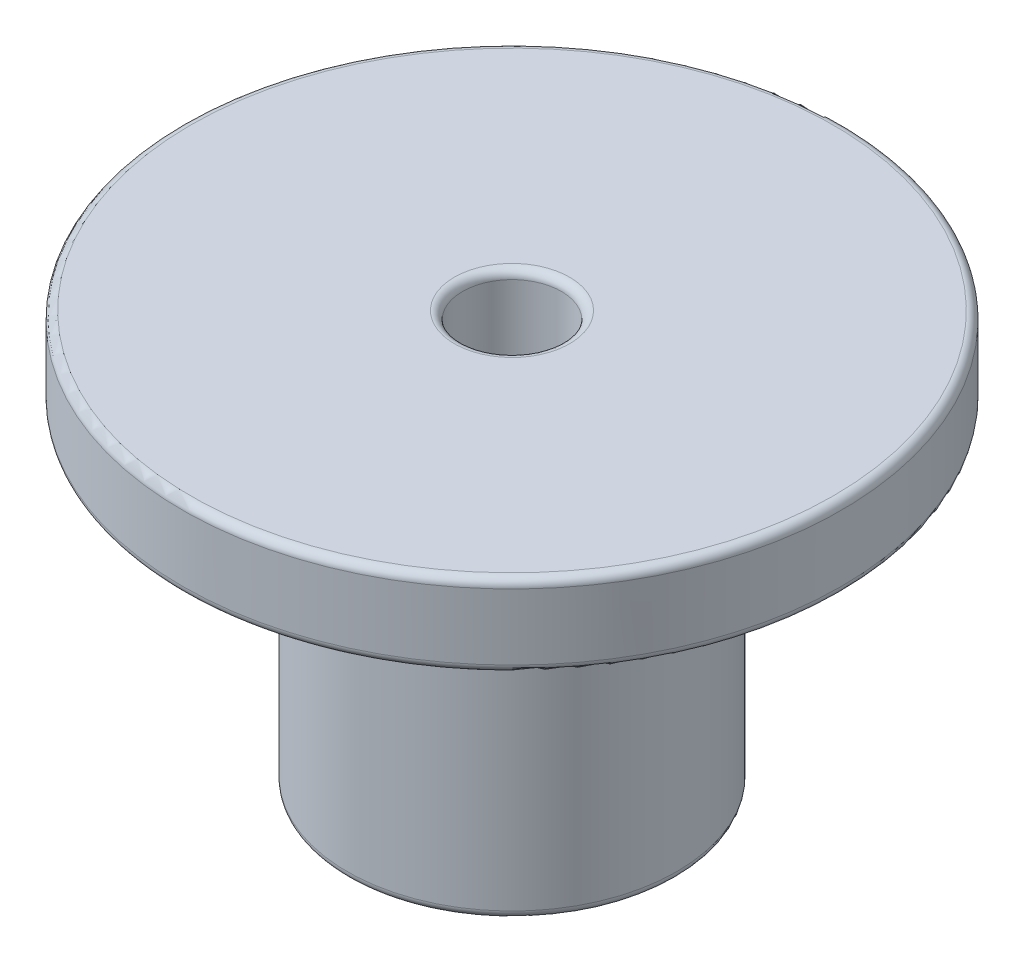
ISO-10303-21;
HEADER;
FILE_DESCRIPTION(('STEP AP214'),'2;1');
FILE_NAME('part.step','',(''),(''),'','','');
FILE_SCHEMA(('AUTOMOTIVE_DESIGN { 1 0 10303 214 1 1 1 1 }'));
ENDSEC;
DATA;
#1=APPLICATION_CONTEXT('core data for automotive mechanical design processes');
#2=APPLICATION_PROTOCOL_DEFINITION('international standard','automotive_design',2000,#1);
#3=PRODUCT_CONTEXT('',#1,'mechanical');
#4=PRODUCT('Part','Part','',(#3));
#5=PRODUCT_RELATED_PRODUCT_CATEGORY('part','',(#4));
#6=PRODUCT_DEFINITION_FORMATION('','',#4);
#7=PRODUCT_DEFINITION_CONTEXT('part definition',#1,'design');
#8=PRODUCT_DEFINITION('design','',#6,#7);
#9=PRODUCT_DEFINITION_SHAPE('','',#8);
#10=(LENGTH_UNIT() NAMED_UNIT(*) SI_UNIT(.MILLI.,.METRE.));
#11=(NAMED_UNIT(*) PLANE_ANGLE_UNIT() SI_UNIT($,.RADIAN.));
#12=(NAMED_UNIT(*) SI_UNIT($,.STERADIAN.) SOLID_ANGLE_UNIT());
#13=UNCERTAINTY_MEASURE_WITH_UNIT(LENGTH_MEASURE(1.E-05),#10,'distance_accuracy_value','');
#14=(GEOMETRIC_REPRESENTATION_CONTEXT(3) GLOBAL_UNCERTAINTY_ASSIGNED_CONTEXT((#13)) GLOBAL_UNIT_ASSIGNED_CONTEXT((#10,
#11,#12)) REPRESENTATION_CONTEXT('',''));
#15=CARTESIAN_POINT('',(0.,0.,0.));
#16=DIRECTION('',(0.,0.,1.));
#17=DIRECTION('',(1.,0.,0.));
#18=AXIS2_PLACEMENT_3D('',#15,#16,#17);
#19=CARTESIAN_POINT('',(-10.,0.,0.));
#20=DIRECTION('',(0.,1.,0.));
#21=DIRECTION('',(-1.,0.,0.));
#22=AXIS2_PLACEMENT_3D('',#19,#20,#21);
#23=PLANE('',#22);
#24=CARTESIAN_POINT('',(0.,0.,0.));
#25=DIRECTION('',(0.,1.,0.));
#26=DIRECTION('',(-1.,0.,0.));
#27=AXIS2_PLACEMENT_3D('',#24,#25,#26);
#28=CIRCLE('',#27,1.75);
#29=CARTESIAN_POINT('',(-1.75,0.,0.));
#30=VERTEX_POINT('',#29);
#31=EDGE_CURVE('E55',#30,#30,#28,.F.);
#32=ORIENTED_EDGE('',*,*,#31,.T.);
#33=EDGE_LOOP('',(#32));
#34=FACE_BOUND('',#33,.T.);
#35=CARTESIAN_POINT('',(0.,0.,0.));
#36=DIRECTION('',(0.,1.,0.));
#37=DIRECTION('',(-1.,0.,0.));
#38=AXIS2_PLACEMENT_3D('',#35,#36,#37);
#39=CIRCLE('',#38,9.75);
#40=CARTESIAN_POINT('',(-9.75,0.,0.));
#41=VERTEX_POINT('',#40);
#42=EDGE_CURVE('E58',#41,#41,#39,.T.);
#43=ORIENTED_EDGE('',*,*,#42,.T.);
#44=EDGE_LOOP('',(#43));
#45=FACE_BOUND('',#44,.T.);
#46=ADVANCED_FACE('F29',(#34,#45),#23,.T.);
#47=CARTESIAN_POINT('',(0.,0.,0.));
#48=DIRECTION('',(0.,1.,0.));
#49=DIRECTION('',(-1.,0.,0.));
#50=AXIS2_PLACEMENT_3D('',#47,#48,#49);
#51=CYLINDRICAL_SURFACE('',#50,1.5);
#52=CARTESIAN_POINT('',(0.,-12.25,0.));
#53=DIRECTION('',(0.,-1.,0.));
#54=DIRECTION('',(1.,0.,0.));
#55=AXIS2_PLACEMENT_3D('',#52,#53,#54);
#56=CIRCLE('',#55,1.5);
#57=CARTESIAN_POINT('',(1.5,-12.25,0.));
#58=VERTEX_POINT('',#57);
#59=EDGE_CURVE('E61',#58,#58,#56,.T.);
#60=ORIENTED_EDGE('',*,*,#59,.T.);
#61=EDGE_LOOP('',(#60));
#62=FACE_BOUND('',#61,.T.);
#63=CARTESIAN_POINT('',(0.,-0.249999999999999,0.));
#64=DIRECTION('',(0.,1.,0.));
#65=DIRECTION('',(-1.,0.,0.));
#66=AXIS2_PLACEMENT_3D('',#63,#64,#65);
#67=CIRCLE('',#66,1.5);
#68=CARTESIAN_POINT('',(-1.5,-0.25,0.));
#69=VERTEX_POINT('',#68);
#70=EDGE_CURVE('E64',#69,#69,#67,.T.);
#71=ORIENTED_EDGE('',*,*,#70,.T.);
#72=EDGE_LOOP('',(#71));
#73=FACE_BOUND('',#72,.T.);
#74=ADVANCED_FACE('F96',(#62,#73),#51,.F.);
#75=CARTESIAN_POINT('',(-1.5,-12.5,0.));
#76=DIRECTION('',(0.,-1.,0.));
#77=DIRECTION('',(1.,0.,0.));
#78=AXIS2_PLACEMENT_3D('',#75,#76,#77);
#79=PLANE('',#78);
#80=CARTESIAN_POINT('',(0.,-12.5,0.));
#81=DIRECTION('',(0.,-1.,0.));
#82=DIRECTION('',(1.,0.,0.));
#83=AXIS2_PLACEMENT_3D('',#80,#81,#82);
#84=CIRCLE('',#83,1.75);
#85=CARTESIAN_POINT('',(1.75,-12.5,0.));
#86=VERTEX_POINT('',#85);
#87=EDGE_CURVE('E67',#86,#86,#84,.F.);
#88=ORIENTED_EDGE('',*,*,#87,.T.);
#89=EDGE_LOOP('',(#88));
#90=FACE_BOUND('',#89,.T.);
#91=CARTESIAN_POINT('',(0.,-12.5,0.));
#92=DIRECTION('',(0.,-1.,0.));
#93=DIRECTION('',(1.,0.,0.));
#94=AXIS2_PLACEMENT_3D('',#91,#92,#93);
#95=CIRCLE('',#94,4.75);
#96=CARTESIAN_POINT('',(4.75,-12.5,0.));
#97=VERTEX_POINT('',#96);
#98=EDGE_CURVE('E70',#97,#97,#95,.T.);
#99=ORIENTED_EDGE('',*,*,#98,.T.);
#100=EDGE_LOOP('',(#99));
#101=FACE_BOUND('',#100,.T.);
#102=ADVANCED_FACE('F74',(#90,#101),#79,.T.);
#103=CARTESIAN_POINT('',(0.,0.,0.));
#104=DIRECTION('',(0.,1.,0.));
#105=DIRECTION('',(-1.,0.,0.));
#106=AXIS2_PLACEMENT_3D('',#103,#104,#105);
#107=CYLINDRICAL_SURFACE('',#106,5.);
#108=CARTESIAN_POINT('',(0.,-2.75,0.));
#109=DIRECTION('',(0.,-1.,0.));
#110=DIRECTION('',(1.,0.,0.));
#111=AXIS2_PLACEMENT_3D('',#108,#109,#110);
#112=CIRCLE('',#111,5.);
#113=CARTESIAN_POINT('',(5.,-2.75,0.));
#114=VERTEX_POINT('',#113);
#115=EDGE_CURVE('E40',#114,#114,#112,.T.);
#116=ORIENTED_EDGE('',*,*,#115,.T.);
#117=EDGE_LOOP('',(#116));
#118=FACE_BOUND('',#117,.T.);
#119=CARTESIAN_POINT('',(0.,-12.25,0.));
#120=DIRECTION('',(0.,-1.,0.));
#121=DIRECTION('',(1.,0.,0.));
#122=AXIS2_PLACEMENT_3D('',#119,#120,#121);
#123=CIRCLE('',#122,5.);
#124=CARTESIAN_POINT('',(5.,-12.25,0.));
#125=VERTEX_POINT('',#124);
#126=EDGE_CURVE('E44',#125,#125,#123,.F.);
#127=ORIENTED_EDGE('',*,*,#126,.T.);
#128=EDGE_LOOP('',(#127));
#129=FACE_BOUND('',#128,.T.);
#130=ADVANCED_FACE('F84',(#118,#129),#107,.T.);
#131=CARTESIAN_POINT('',(-5.,-2.5,0.));
#132=DIRECTION('',(0.,-1.,0.));
#133=DIRECTION('',(1.,0.,0.));
#134=AXIS2_PLACEMENT_3D('',#131,#132,#133);
#135=PLANE('',#134);
#136=CARTESIAN_POINT('',(0.,-2.5,0.));
#137=DIRECTION('',(0.,-1.,0.));
#138=DIRECTION('',(1.,0.,0.));
#139=AXIS2_PLACEMENT_3D('',#136,#137,#138);
#140=CIRCLE('',#139,5.25);
#141=CARTESIAN_POINT('',(5.25,-2.5,0.));
#142=VERTEX_POINT('',#141);
#143=EDGE_CURVE('E49',#142,#142,#140,.F.);
#144=ORIENTED_EDGE('',*,*,#143,.T.);
#145=EDGE_LOOP('',(#144));
#146=FACE_BOUND('',#145,.T.);
#147=CARTESIAN_POINT('',(0.,-2.5,0.));
#148=DIRECTION('',(0.,-1.,0.));
#149=DIRECTION('',(1.,0.,0.));
#150=AXIS2_PLACEMENT_3D('',#147,#148,#149);
#151=CIRCLE('',#150,9.75);
#152=CARTESIAN_POINT('',(9.75,-2.5,0.));
#153=VERTEX_POINT('',#152);
#154=EDGE_CURVE('E52',#153,#153,#151,.T.);
#155=ORIENTED_EDGE('',*,*,#154,.T.);
#156=EDGE_LOOP('',(#155));
#157=FACE_BOUND('',#156,.T.);
#158=ADVANCED_FACE('F86',(#146,#157),#135,.T.);
#159=CARTESIAN_POINT('',(0.,0.,0.));
#160=DIRECTION('',(0.,1.,0.));
#161=DIRECTION('',(-1.,0.,0.));
#162=AXIS2_PLACEMENT_3D('',#159,#160,#161);
#163=CYLINDRICAL_SURFACE('',#162,10.);
#164=CARTESIAN_POINT('',(0.,-0.249999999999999,0.));
#165=DIRECTION('',(0.,1.,0.));
#166=DIRECTION('',(-1.,0.,0.));
#167=AXIS2_PLACEMENT_3D('',#164,#165,#166);
#168=CIRCLE('',#167,10.);
#169=CARTESIAN_POINT('',(-10.,-0.250000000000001,0.));
#170=VERTEX_POINT('',#169);
#171=EDGE_CURVE('E10',#170,#170,#168,.F.);
#172=ORIENTED_EDGE('',*,*,#171,.T.);
#173=EDGE_LOOP('',(#172));
#174=FACE_BOUND('',#173,.T.);
#175=CARTESIAN_POINT('',(0.,-2.25,0.));
#176=DIRECTION('',(0.,-1.,0.));
#177=DIRECTION('',(1.,0.,0.));
#178=AXIS2_PLACEMENT_3D('',#175,#176,#177);
#179=CIRCLE('',#178,10.);
#180=CARTESIAN_POINT('',(10.,-2.25,0.));
#181=VERTEX_POINT('',#180);
#182=EDGE_CURVE('E36',#181,#181,#179,.F.);
#183=ORIENTED_EDGE('',*,*,#182,.T.);
#184=EDGE_LOOP('',(#183));
#185=FACE_BOUND('',#184,.T.);
#186=ADVANCED_FACE('F93',(#174,#185),#163,.T.);
#187=CARTESIAN_POINT('',(0.,-12.25,0.));
#188=DIRECTION('',(0.,-1.,0.));
#189=DIRECTION('',(1.,0.,0.));
#190=AXIS2_PLACEMENT_3D('',#187,#188,#189);
#191=TOROIDAL_SURFACE('',#190,1.75,0.25);
#192=ORIENTED_EDGE('',*,*,#59,.F.);
#193=EDGE_LOOP('',(#192));
#194=FACE_BOUND('',#193,.T.);
#195=ORIENTED_EDGE('',*,*,#87,.F.);
#196=EDGE_LOOP('',(#195));
#197=FACE_BOUND('',#196,.T.);
#198=ADVANCED_FACE('F109',(#194,#197),#191,.T.);
#199=CARTESIAN_POINT('',(0.,-0.249999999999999,0.));
#200=DIRECTION('',(0.,1.,0.));
#201=DIRECTION('',(-1.,0.,0.));
#202=AXIS2_PLACEMENT_3D('',#199,#200,#201);
#203=TOROIDAL_SURFACE('',#202,1.75,0.25);
#204=ORIENTED_EDGE('',*,*,#31,.F.);
#205=EDGE_LOOP('',(#204));
#206=FACE_BOUND('',#205,.T.);
#207=ORIENTED_EDGE('',*,*,#70,.F.);
#208=EDGE_LOOP('',(#207));
#209=FACE_BOUND('',#208,.T.);
#210=ADVANCED_FACE('F112',(#206,#209),#203,.T.);
#211=CARTESIAN_POINT('',(0.,-2.75,0.));
#212=DIRECTION('',(0.,-1.,0.));
#213=DIRECTION('',(1.,0.,0.));
#214=AXIS2_PLACEMENT_3D('',#211,#212,#213);
#215=TOROIDAL_SURFACE('',#214,5.25,0.25);
#216=ORIENTED_EDGE('',*,*,#115,.F.);
#217=EDGE_LOOP('',(#216));
#218=FACE_BOUND('',#217,.T.);
#219=ORIENTED_EDGE('',*,*,#143,.F.);
#220=EDGE_LOOP('',(#219));
#221=FACE_BOUND('',#220,.T.);
#222=ADVANCED_FACE('F80',(#218,#221),#215,.F.);
#223=CARTESIAN_POINT('',(0.,-12.25,0.));
#224=DIRECTION('',(0.,-1.,0.));
#225=DIRECTION('',(1.,0.,0.));
#226=AXIS2_PLACEMENT_3D('',#223,#224,#225);
#227=TOROIDAL_SURFACE('',#226,4.75,0.25);
#228=ORIENTED_EDGE('',*,*,#98,.F.);
#229=EDGE_LOOP('',(#228));
#230=FACE_BOUND('',#229,.T.);
#231=ORIENTED_EDGE('',*,*,#126,.F.);
#232=EDGE_LOOP('',(#231));
#233=FACE_BOUND('',#232,.T.);
#234=ADVANCED_FACE('F76',(#230,#233),#227,.T.);
#235=CARTESIAN_POINT('',(0.,-0.249999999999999,0.));
#236=DIRECTION('',(0.,1.,0.));
#237=DIRECTION('',(-1.,0.,0.));
#238=AXIS2_PLACEMENT_3D('',#235,#236,#237);
#239=TOROIDAL_SURFACE('',#238,9.75,0.25);
#240=ORIENTED_EDGE('',*,*,#171,.F.);
#241=EDGE_LOOP('',(#240));
#242=FACE_BOUND('',#241,.T.);
#243=ORIENTED_EDGE('',*,*,#42,.F.);
#244=EDGE_LOOP('',(#243));
#245=FACE_BOUND('',#244,.T.);
#246=ADVANCED_FACE('F79',(#242,#245),#239,.T.);
#247=CARTESIAN_POINT('',(0.,-2.25,0.));
#248=DIRECTION('',(0.,-1.,0.));
#249=DIRECTION('',(1.,0.,0.));
#250=AXIS2_PLACEMENT_3D('',#247,#248,#249);
#251=TOROIDAL_SURFACE('',#250,9.75,0.25);
#252=ORIENTED_EDGE('',*,*,#154,.F.);
#253=EDGE_LOOP('',(#252));
#254=FACE_BOUND('',#253,.T.);
#255=ORIENTED_EDGE('',*,*,#182,.F.);
#256=EDGE_LOOP('',(#255));
#257=FACE_BOUND('',#256,.T.);
#258=ADVANCED_FACE('F31',(#254,#257),#251,.T.);
#259=CLOSED_SHELL('',(#46,#74,#102,#130,#158,#186,#198,#210,#222,#234,#246,#258));
#260=MANIFOLD_SOLID_BREP('B2',#259);
#261=ADVANCED_BREP_SHAPE_REPRESENTATION('',(#18,#260),#14);
#262=SHAPE_DEFINITION_REPRESENTATION(#9,#261);
ENDSEC;
END-ISO-10303-21;
